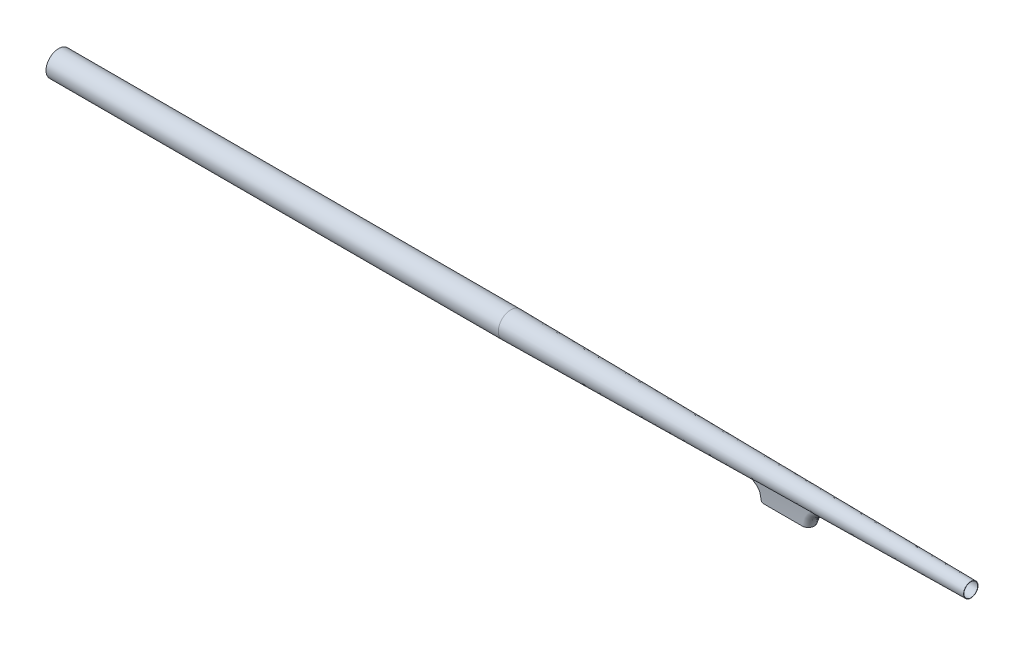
from build123d import *


with BuildPart() as part:
    # Skizze1 → Rotation1 (revolve)
    with BuildSketch(Plane.XY, mode=Mode.PRIVATE) as rotation1_sk:
        Polygon((0, 8.2), (0, 8), (295, 8), (595, 4.5), (595, 4.7), (295, 8.2), align=None)
    revolve(rotation1_sk.sketch.rotate(Axis((0, 0, 0), (1, 0, 0)), 90), axis=Axis((0, 0, 0), (1, 0, 0)))


solid = part.part
